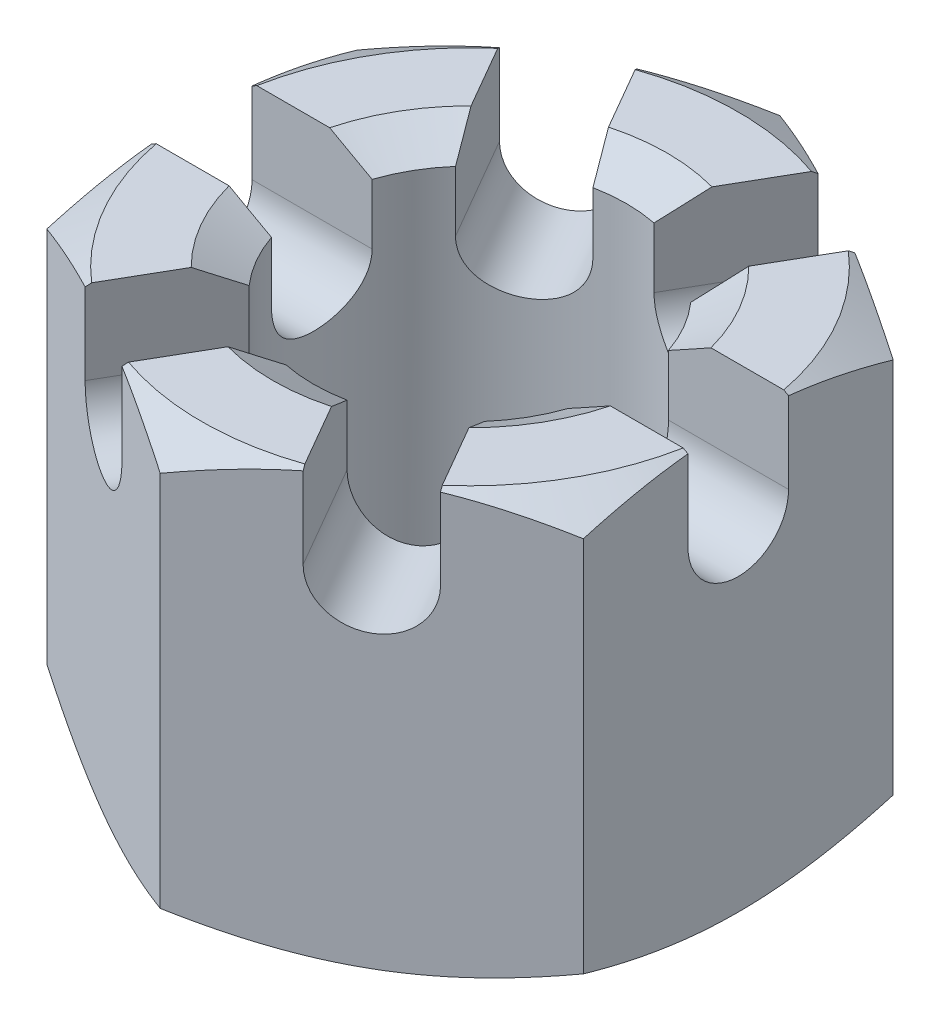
from build123d import *

# Parameters (mm, degrees)
BASENUT_DEPTH    = 19
HOLESKE_R        = 7
TAPPEDHOLE_DEPTH = 27.400757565
CHAMFER1_SIZE    = 1.05
CHAMFER1_SIZE2   = 1.818653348
SLOT_DEPTH       = 28.8
SLOTPAT_COUNT    = 6


with BuildPart() as part:
    # BaseNutSke → BaseNut (new body)
    with BuildSketch(Plane(origin=(0, 0, 0), x_dir=(1, 0, 0), z_dir=(0, 1, 0))):
        Polygon((0, 13.856406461), (-12, 6.92820323), (-12, -6.92820323), (0, -13.856406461), (12, -6.92820323), (12, 6.92820323), align=None)
    extrude(amount=BASENUT_DEPTH)

    # CutNutSke → CutNut (revolve, cut)
    with BuildSketch(Plane(origin=(0, 0, 0), x_dir=(0, 0, -1), z_dir=(1, 0, 0))):
        Polygon((-13.856406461, 19), (-12, 19), (-13.856406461, 17.92820323), align=None)
    cutnut = revolve(axis=Axis((0, 0, 0), (0, 1, 0)), mode=Mode.SUBTRACT)

    # MirrorChamfer: CutNut across plane
    add(cutnut.mirror(Plane.ZX.offset(9.5)), mode=Mode.SUBTRACT)

    # HoleSke → TappedHole (cut, through all)
    with BuildSketch(Plane(origin=(0, 19, 0), x_dir=(1, 0, 0), z_dir=(0, 1, 0))):
        with Locations(Location((0, 0, 0), (0, 0, 270))):
            Circle(HOLESKE_R)
    extrude(amount=-TAPPEDHOLE_DEPTH, mode=Mode.SUBTRACT)

    # Chamfer1
    chamfer1_edges = [part.edges().sort_by_distance(p)[0] for p in [
        (0, 0, -7),
        (0, 19, -7),
    ]]
    chamfer1_side = [part.faces().sort_by_distance(p)[0] for p in [
        (0, 9.5, -7),
    ]]
    chamfer(chamfer1_edges, length=CHAMFER1_SIZE, length2=CHAMFER1_SIZE2, reference=chamfer1_side[0])

    # SlotSke → Slot (cut)
    with BuildSketch(Plane(origin=(0, 0, 0), x_dir=(0, 0, -1), z_dir=(1, 0, 0))):
        with BuildLine():
            Line((-2.25, 32), (2.25, 32))
            Line((2.25, 32), (2.25, 15.25))
            ThreePointArc((2.25, 15.25), (0, 13), (-2.25, 15.25))
            Line((-2.25, 15.25), (-2.25, 32))
        make_face()
    slot = extrude(amount=-SLOT_DEPTH, mode=Mode.SUBTRACT)

    # SlotPat: Slot ×6 about axis
    slotpat_axis = Axis((0, 0, 0), (0, 1, 0))
    for i in range(1, SLOTPAT_COUNT):
        add(slot.rotate(slotpat_axis, i * 360 / SLOTPAT_COUNT), mode=Mode.SUBTRACT)


solid = part.part
